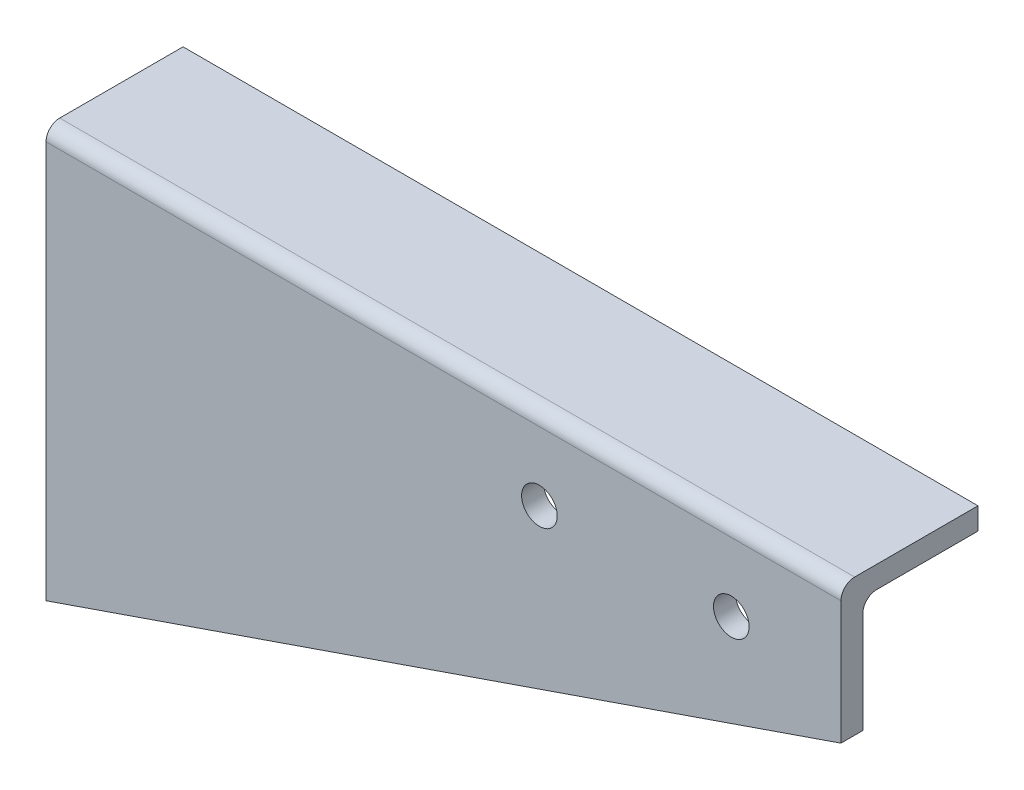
from build123d import *

# Parameters (mm, degrees)
EXTRUDE_1_DEPTH     = 8
SKETCH_2_W          = 290
SKETCH_2_H          = 8
EXTRUDE_2_DEPTH     = 42
SKETCH_3_R          = 6.5
CUT_EXTRUDE_1_DEPTH = 331.302891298
FILLET_1_R          = 5


with BuildPart() as part:
    # Sketch 1 → Extrude 1 (new body)
    with BuildSketch(Plane.XY):
        Polygon((0, 0), (290, 0), (290, -50), (0, -150), align=None)
    extrude(amount=EXTRUDE_1_DEPTH)

    # Sketch 2 → Extrude 2 (add)
    with BuildSketch(Plane(origin=(0, 0, 0), x_dir=(-1, 0, 0), z_dir=(0, 0, -1))):
        with Locations((-145, -4)):
            Rectangle(SKETCH_2_W, SKETCH_2_H)
    extrude(amount=EXTRUDE_2_DEPTH)

    # Sketch 3 → Cut-Extrude 1 (cut, through all)
    with BuildSketch(Plane.XY.offset(8)):
        with Locations((250, -30)):
            Circle(SKETCH_3_R)
        with Locations((180, -30)):
            Circle(SKETCH_3_R)
    extrude(amount=-CUT_EXTRUDE_1_DEPTH, mode=Mode.SUBTRACT)

    # Fillet 1
    fillet_1_edges = [part.edges().sort_by_distance(p)[0] for p in [
        (145, -8, 0),
        (145, 0, 8),
    ]]
    fillet(fillet_1_edges, radius=FILLET_1_R)


solid = part.part
